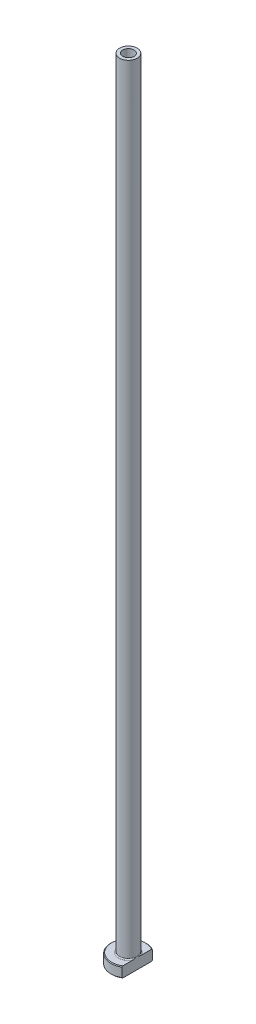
ISO-10303-21;
HEADER;
FILE_DESCRIPTION(('STEP AP214'),'2;1');
FILE_NAME('part.step','',(''),(''),'','','');
FILE_SCHEMA(('AUTOMOTIVE_DESIGN { 1 0 10303 214 1 1 1 1 }'));
ENDSEC;
DATA;
#1=APPLICATION_CONTEXT('core data for automotive mechanical design processes');
#2=APPLICATION_PROTOCOL_DEFINITION('international standard','automotive_design',2000,#1);
#3=PRODUCT_CONTEXT('',#1,'mechanical');
#4=PRODUCT('Part','Part','',(#3));
#5=PRODUCT_RELATED_PRODUCT_CATEGORY('part','',(#4));
#6=PRODUCT_DEFINITION_FORMATION('','',#4);
#7=PRODUCT_DEFINITION_CONTEXT('part definition',#1,'design');
#8=PRODUCT_DEFINITION('design','',#6,#7);
#9=PRODUCT_DEFINITION_SHAPE('','',#8);
#10=(LENGTH_UNIT() NAMED_UNIT(*) SI_UNIT(.MILLI.,.METRE.));
#11=(NAMED_UNIT(*) PLANE_ANGLE_UNIT() SI_UNIT($,.RADIAN.));
#12=(NAMED_UNIT(*) SI_UNIT($,.STERADIAN.) SOLID_ANGLE_UNIT());
#13=UNCERTAINTY_MEASURE_WITH_UNIT(LENGTH_MEASURE(1.E-05),#10,'distance_accuracy_value','');
#14=(GEOMETRIC_REPRESENTATION_CONTEXT(3) GLOBAL_UNCERTAINTY_ASSIGNED_CONTEXT((#13)) GLOBAL_UNIT_ASSIGNED_CONTEXT((#10,
#11,#12)) REPRESENTATION_CONTEXT('',''));
#15=CARTESIAN_POINT('',(0.,0.,0.));
#16=DIRECTION('',(0.,0.,1.));
#17=DIRECTION('',(1.,0.,0.));
#18=AXIS2_PLACEMENT_3D('',#15,#16,#17);
#19=CARTESIAN_POINT('',(0.,92.1876809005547,0.));
#20=DIRECTION('',(0.,1.,0.));
#21=DIRECTION('',(0.,0.,1.));
#22=AXIS2_PLACEMENT_3D('',#19,#20,#21);
#23=CYLINDRICAL_SURFACE('',#22,1.60000000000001);
#24=CARTESIAN_POINT('',(0.,225.,0.));
#25=DIRECTION('',(0.,1.,0.));
#26=DIRECTION('',(0.,0.,1.));
#27=AXIS2_PLACEMENT_3D('',#24,#25,#26);
#28=CIRCLE('',#27,1.60000000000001);
#29=CARTESIAN_POINT('',(0.,225.,1.60000000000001));
#30=VERTEX_POINT('',#29);
#31=EDGE_CURVE('E167',#30,#30,#28,.T.);
#32=ORIENTED_EDGE('',*,*,#31,.T.);
#33=EDGE_LOOP('',(#32));
#34=FACE_BOUND('',#33,.T.);
#35=CARTESIAN_POINT('',(0.,180.,0.));
#36=DIRECTION('',(0.,1.,0.));
#37=DIRECTION('',(0.,0.,1.));
#38=AXIS2_PLACEMENT_3D('',#35,#36,#37);
#39=CIRCLE('',#38,1.60000000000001);
#40=CARTESIAN_POINT('',(0.,180.,1.60000000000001));
#41=VERTEX_POINT('',#40);
#42=EDGE_CURVE('E170',#41,#41,#39,.T.);
#43=ORIENTED_EDGE('',*,*,#42,.F.);
#44=EDGE_LOOP('',(#43));
#45=FACE_BOUND('',#44,.T.);
#46=ADVANCED_FACE('F32',(#34,#45),#23,.F.);
#47=CARTESIAN_POINT('',(-1.60000000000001,225.,0.));
#48=DIRECTION('',(0.,1.,0.));
#49=DIRECTION('',(0.,0.,1.));
#50=AXIS2_PLACEMENT_3D('',#47,#48,#49);
#51=PLANE('',#50);
#52=CARTESIAN_POINT('',(0.,225.,0.));
#53=DIRECTION('',(0.,1.,0.));
#54=DIRECTION('',(0.,0.,1.));
#55=AXIS2_PLACEMENT_3D('',#52,#53,#54);
#56=CIRCLE('',#55,2.50000000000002);
#57=CARTESIAN_POINT('',(0.,225.,2.50000000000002));
#58=VERTEX_POINT('',#57);
#59=EDGE_CURVE('E174',#58,#58,#56,.T.);
#60=ORIENTED_EDGE('',*,*,#59,.T.);
#61=EDGE_LOOP('',(#60));
#62=FACE_BOUND('',#61,.T.);
#63=ORIENTED_EDGE('',*,*,#31,.F.);
#64=EDGE_LOOP('',(#63));
#65=FACE_BOUND('',#64,.T.);
#66=ADVANCED_FACE('F157',(#62,#65),#51,.T.);
#67=CARTESIAN_POINT('',(0.,92.1876809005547,0.));
#68=DIRECTION('',(0.,1.,0.));
#69=DIRECTION('',(0.,0.,1.));
#70=AXIS2_PLACEMENT_3D('',#67,#68,#69);
#71=CYLINDRICAL_SURFACE('',#70,2.5);
#72=CARTESIAN_POINT('',(0.,3.3,0.));
#73=DIRECTION('',(0.,1.,0.));
#74=DIRECTION('',(0.,0.,1.));
#75=AXIS2_PLACEMENT_3D('',#72,#73,#74);
#76=CIRCLE('',#75,2.5);
#77=CARTESIAN_POINT('',(2.5,3.3,0.));
#78=VERTEX_POINT('',#77);
#79=EDGE_CURVE('E180',#78,#78,#76,.T.);
#80=ORIENTED_EDGE('',*,*,#79,.T.);
#81=EDGE_LOOP('',(#80));
#82=FACE_BOUND('',#81,.T.);
#83=ORIENTED_EDGE('',*,*,#59,.F.);
#84=EDGE_LOOP('',(#83));
#85=FACE_BOUND('',#84,.T.);
#86=ADVANCED_FACE('F162',(#82,#85),#71,.T.);
#87=CARTESIAN_POINT('',(-2.49999999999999,3.,0.));
#88=DIRECTION('',(0.,1.,0.));
#89=DIRECTION('',(0.,0.,1.));
#90=AXIS2_PLACEMENT_3D('',#87,#88,#89);
#91=PLANE('',#90);
#92=DIRECTION('',(0.,0.,1.));
#93=VECTOR('',#92,1.);
#94=CARTESIAN_POINT('',(2.49999999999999,3.,0.));
#95=LINE('',#94,#93);
#96=CARTESIAN_POINT('',(2.49999999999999,3.,-4.09756024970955));
#97=VERTEX_POINT('',#96);
#98=CARTESIAN_POINT('',(2.49999999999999,3.,-1.26095202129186));
#99=VERTEX_POINT('',#98);
#100=EDGE_CURVE('E54',#97,#99,#95,.T.);
#101=ORIENTED_EDGE('',*,*,#100,.F.);
#102=CARTESIAN_POINT('',(0.,3.,0.));
#103=DIRECTION('',(0.,1.,0.));
#104=DIRECTION('',(0.,0.,1.));
#105=AXIS2_PLACEMENT_3D('',#102,#103,#104);
#106=CIRCLE('',#105,4.79999999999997);
#107=CARTESIAN_POINT('',(2.49999999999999,3.,4.09756024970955));
#108=VERTEX_POINT('',#107);
#109=EDGE_CURVE('E186',#97,#108,#106,.T.);
#110=ORIENTED_EDGE('',*,*,#109,.T.);
#111=CARTESIAN_POINT('',(2.49999999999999,3.,1.26095202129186));
#112=VERTEX_POINT('',#111);
#113=EDGE_CURVE('E134',#112,#108,#95,.T.);
#114=ORIENTED_EDGE('',*,*,#113,.F.);
#115=CARTESIAN_POINT('',(0.,3.,0.));
#116=DIRECTION('',(0.,1.,0.));
#117=DIRECTION('',(0.,0.,1.));
#118=AXIS2_PLACEMENT_3D('',#115,#116,#117);
#119=CIRCLE('',#118,2.8);
#120=EDGE_CURVE('E183',#112,#99,#119,.F.);
#121=ORIENTED_EDGE('',*,*,#120,.T.);
#122=EDGE_LOOP('',(#101,#110,#114,#121));
#123=FACE_BOUND('',#122,.T.);
#124=ADVANCED_FACE('F197',(#123),#91,.T.);
#125=CARTESIAN_POINT('',(0.,92.1876809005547,0.));
#126=DIRECTION('',(0.,1.,0.));
#127=DIRECTION('',(0.,0.,1.));
#128=AXIS2_PLACEMENT_3D('',#125,#126,#127);
#129=CYLINDRICAL_SURFACE('',#128,4.99999999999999);
#130=DIRECTION('',(0.,-1.,0.));
#131=VECTOR('',#130,1.);
#132=CARTESIAN_POINT('',(2.49999999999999,225.,4.33012701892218));
#133=LINE('',#132,#131);
#134=CARTESIAN_POINT('',(2.49999999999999,2.79999999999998,4.33012701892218));
#135=VERTEX_POINT('',#134);
#136=CARTESIAN_POINT('',(2.49999999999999,0.200000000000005,4.33012701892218));
#137=VERTEX_POINT('',#136);
#138=EDGE_CURVE('E82',#135,#137,#133,.T.);
#139=ORIENTED_EDGE('',*,*,#138,.F.);
#140=CARTESIAN_POINT('',(0.,2.79999999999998,0.));
#141=DIRECTION('',(0.,1.,0.));
#142=DIRECTION('',(0.,0.,1.));
#143=AXIS2_PLACEMENT_3D('',#140,#141,#142);
#144=CIRCLE('',#143,4.99999999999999);
#145=CARTESIAN_POINT('',(2.49999999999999,2.79999999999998,-4.33012701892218));
#146=VERTEX_POINT('',#145);
#147=EDGE_CURVE('E95',#135,#146,#144,.F.);
#148=ORIENTED_EDGE('',*,*,#147,.T.);
#149=DIRECTION('',(0.,-1.,0.));
#150=VECTOR('',#149,1.);
#151=CARTESIAN_POINT('',(2.49999999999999,225.,-4.33012701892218));
#152=LINE('',#151,#150);
#153=CARTESIAN_POINT('',(2.49999999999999,0.200000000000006,-4.33012701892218));
#154=VERTEX_POINT('',#153);
#155=EDGE_CURVE('E192',#146,#154,#152,.T.);
#156=ORIENTED_EDGE('',*,*,#155,.T.);
#157=CARTESIAN_POINT('',(0.,0.200000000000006,0.));
#158=DIRECTION('',(0.,-1.,0.));
#159=DIRECTION('',(0.,0.,-1.));
#160=AXIS2_PLACEMENT_3D('',#157,#158,#159);
#161=CIRCLE('',#160,4.99999999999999);
#162=EDGE_CURVE('E98',#154,#137,#161,.F.);
#163=ORIENTED_EDGE('',*,*,#162,.T.);
#164=EDGE_LOOP('',(#139,#148,#156,#163));
#165=FACE_BOUND('',#164,.T.);
#166=ADVANCED_FACE('F190',(#165),#129,.T.);
#167=CARTESIAN_POINT('',(-4.99999999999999,0.,0.));
#168=DIRECTION('',(0.,-1.,0.));
#169=DIRECTION('',(0.,0.,-1.));
#170=AXIS2_PLACEMENT_3D('',#167,#168,#169);
#171=PLANE('',#170);
#172=CARTESIAN_POINT('',(0.,0.,0.));
#173=DIRECTION('',(0.,-1.,0.));
#174=DIRECTION('',(0.,0.,-1.));
#175=AXIS2_PLACEMENT_3D('',#172,#173,#174);
#176=CIRCLE('',#175,2.34999999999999);
#177=CARTESIAN_POINT('',(0.,0.,-2.34999999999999));
#178=VERTEX_POINT('',#177);
#179=EDGE_CURVE('E40',#178,#178,#176,.F.);
#180=ORIENTED_EDGE('',*,*,#179,.T.);
#181=EDGE_LOOP('',(#180));
#182=FACE_BOUND('',#181,.T.);
#183=DIRECTION('',(0.,0.,-1.));
#184=VECTOR('',#183,1.);
#185=CARTESIAN_POINT('',(2.49999999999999,0.,4.33012701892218));
#186=LINE('',#185,#184);
#187=CARTESIAN_POINT('',(2.49999999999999,0.,4.09756024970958));
#188=VERTEX_POINT('',#187);
#189=CARTESIAN_POINT('',(2.49999999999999,0.,-4.09756024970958));
#190=VERTEX_POINT('',#189);
#191=EDGE_CURVE('E47',#188,#190,#186,.T.);
#192=ORIENTED_EDGE('',*,*,#191,.F.);
#193=CARTESIAN_POINT('',(0.,0.,0.));
#194=DIRECTION('',(0.,-1.,0.));
#195=DIRECTION('',(0.,0.,-1.));
#196=AXIS2_PLACEMENT_3D('',#193,#194,#195);
#197=CIRCLE('',#196,4.8);
#198=EDGE_CURVE('E92',#188,#190,#197,.T.);
#199=ORIENTED_EDGE('',*,*,#198,.T.);
#200=EDGE_LOOP('',(#192,#199));
#201=FACE_BOUND('',#200,.T.);
#202=ADVANCED_FACE('F91',(#182,#201),#171,.T.);
#203=CARTESIAN_POINT('',(0.,92.1876809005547,0.));
#204=DIRECTION('',(0.,1.,0.));
#205=DIRECTION('',(0.,0.,1.));
#206=AXIS2_PLACEMENT_3D('',#203,#204,#205);
#207=CYLINDRICAL_SURFACE('',#206,1.85);
#208=CARTESIAN_POINT('',(0.,0.500000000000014,0.));
#209=DIRECTION('',(0.,-1.,0.));
#210=DIRECTION('',(0.,0.,-1.));
#211=AXIS2_PLACEMENT_3D('',#208,#209,#210);
#212=CIRCLE('',#211,1.85);
#213=CARTESIAN_POINT('',(0.,0.500000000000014,-1.85));
#214=VERTEX_POINT('',#213);
#215=EDGE_CURVE('E11',#214,#214,#212,.T.);
#216=ORIENTED_EDGE('',*,*,#215,.T.);
#217=EDGE_LOOP('',(#216));
#218=FACE_BOUND('',#217,.T.);
#219=CARTESIAN_POINT('',(0.,168.,0.));
#220=DIRECTION('',(0.,1.,0.));
#221=DIRECTION('',(0.,0.,1.));
#222=AXIS2_PLACEMENT_3D('',#219,#220,#221);
#223=CIRCLE('',#222,1.85000000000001);
#224=CARTESIAN_POINT('',(0.,168.,1.85000000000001));
#225=VERTEX_POINT('',#224);
#226=EDGE_CURVE('E172',#225,#225,#223,.T.);
#227=ORIENTED_EDGE('',*,*,#226,.T.);
#228=EDGE_LOOP('',(#227));
#229=FACE_BOUND('',#228,.T.);
#230=ADVANCED_FACE('F215',(#218,#229),#207,.F.);
#231=CARTESIAN_POINT('',(0.,168.,0.));
#232=DIRECTION('',(0.,-1.,0.));
#233=DIRECTION('',(0.,0.,-1.));
#234=AXIS2_PLACEMENT_3D('',#231,#232,#233);
#235=CONICAL_SURFACE('',#234,1.85000000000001,0.0208303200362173);
#236=ORIENTED_EDGE('',*,*,#42,.T.);
#237=EDGE_LOOP('',(#236));
#238=FACE_BOUND('',#237,.T.);
#239=ORIENTED_EDGE('',*,*,#226,.F.);
#240=EDGE_LOOP('',(#239));
#241=FACE_BOUND('',#240,.T.);
#242=ADVANCED_FACE('F111',(#238,#241),#235,.F.);
#243=CARTESIAN_POINT('',(0.,3.3,0.));
#244=DIRECTION('',(0.,1.,0.));
#245=DIRECTION('',(0.,0.,1.));
#246=AXIS2_PLACEMENT_3D('',#243,#244,#245);
#247=TOROIDAL_SURFACE('',#246,2.8,0.3);
#248=ORIENTED_EDGE('',*,*,#120,.F.);
#249=CARTESIAN_POINT('',(2.5,3.3,0.));
#250=CARTESIAN_POINT('',(2.5,3.30000062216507,-4.8426698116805E-11));
#251=CARTESIAN_POINT('',(2.5,3.30000124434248,1.59621067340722E-07));
#252=CARTESIAN_POINT('',(2.5,3.30000243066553,6.45478006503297E-07));
#253=CARTESIAN_POINT('',(2.5,3.30000299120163,9.78480760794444E-07));
#254=CARTESIAN_POINT('',(2.5,3.30000411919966,1.77471990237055E-06));
#255=CARTESIAN_POINT('',(2.5,3.30000467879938,2.24902156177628E-06));
#256=CARTESIAN_POINT('',(2.5,3.30000572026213,3.25953696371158E-06));
#257=CARTESIAN_POINT('',(2.5,3.30000620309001,3.79480759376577E-06));
#258=CARTESIAN_POINT('',(2.5,3.30000787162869,5.75794663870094E-06));
#259=CARTESIAN_POINT('',(2.5,3.300008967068,7.26424163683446E-06));
#260=CARTESIAN_POINT('',(2.5,3.30001087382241,1.03361136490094E-05));
#261=CARTESIAN_POINT('',(2.5,3.30001169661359,1.18949506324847E-05));
#262=CARTESIAN_POINT('',(2.5,3.30001489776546,1.81400864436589E-05));
#263=CARTESIAN_POINT('',(2.5,3.30001712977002,2.29062195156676E-05));
#264=CARTESIAN_POINT('',(2.5,3.30002067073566,3.21793887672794E-05));
#265=CARTESIAN_POINT('',(2.5,3.30002205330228,3.66589008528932E-05));
#266=CARTESIAN_POINT('',(2.5,3.30002810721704,5.61718435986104E-05));
#267=CARTESIAN_POINT('',(2.5,3.30003284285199,7.11735908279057E-05));
#268=CARTESIAN_POINT('',(2.49999999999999,3.3000402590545,9.89920379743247E-05));
#269=CARTESIAN_POINT('',(2.49999999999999,3.30004315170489,0.000111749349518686));
#270=CARTESIAN_POINT('',(2.49999999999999,3.30006652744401,0.000206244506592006));
#271=CARTESIAN_POINT('',(2.49999999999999,3.30009698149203,0.000285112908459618));
#272=CARTESIAN_POINT('',(2.5,3.30021213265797,0.000594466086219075));
#273=CARTESIAN_POINT('',(2.5,3.30028938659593,0.000826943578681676));
#274=CARTESIAN_POINT('',(2.49999999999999,3.30059681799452,0.00173885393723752));
#275=CARTESIAN_POINT('',(2.49999999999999,3.30083479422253,0.00241625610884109));
#276=CARTESIAN_POINT('',(2.5,3.30181198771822,0.00521069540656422));
#277=CARTESIAN_POINT('',(2.5,3.30254240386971,0.0073299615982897));
#278=CARTESIAN_POINT('',(2.49999999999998,3.31226043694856,0.0355096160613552));
#279=CARTESIAN_POINT('',(2.49999999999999,3.32130808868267,0.061555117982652));
#280=CARTESIAN_POINT('',(2.5,3.33896212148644,0.112677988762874));
#281=CARTESIAN_POINT('',(2.5,3.34757212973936,0.137754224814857));
#282=CARTESIAN_POINT('',(2.49999999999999,3.3657306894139,0.190981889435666));
#283=CARTESIAN_POINT('',(2.49999999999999,3.37526654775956,0.21913775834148));
#284=CARTESIAN_POINT('',(2.49999999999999,3.39422867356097,0.275816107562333));
#285=CARTESIAN_POINT('',(2.49999999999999,3.40365272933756,0.304339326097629));
#286=CARTESIAN_POINT('',(2.49999999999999,3.42641697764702,0.374416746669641));
#287=CARTESIAN_POINT('',(2.49999999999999,3.43959811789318,0.416023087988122));
#288=CARTESIAN_POINT('',(2.49999999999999,3.46479157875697,0.498481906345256));
#289=CARTESIAN_POINT('',(2.49999999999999,3.47682455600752,0.53932804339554));
#290=CARTESIAN_POINT('',(2.49999999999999,3.50224427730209,0.629981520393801));
#291=CARTESIAN_POINT('',(2.49999999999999,3.51538048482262,0.679860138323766));
#292=CARTESIAN_POINT('',(2.49999999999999,3.53964074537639,0.78051176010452));
#293=CARTESIAN_POINT('',(2.49999999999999,3.55074877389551,0.831288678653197));
#294=CARTESIAN_POINT('',(2.49999999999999,3.57087054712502,0.937063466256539));
#295=CARTESIAN_POINT('',(2.49999999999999,3.5796762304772,0.99210227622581));
#296=CARTESIAN_POINT('',(2.49999999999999,3.59301148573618,1.10256024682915));
#297=CARTESIAN_POINT('',(2.49999999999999,3.59755297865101,1.15797790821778));
#298=CARTESIAN_POINT('',(2.49999999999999,3.60093314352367,1.26786705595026));
#299=CARTESIAN_POINT('',(2.49999999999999,3.59989366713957,1.32233291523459));
#300=CARTESIAN_POINT('',(2.49999999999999,3.592772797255,1.40310062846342));
#301=CARTESIAN_POINT('',(2.49999999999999,3.58952137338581,1.42965222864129));
#302=CARTESIAN_POINT('',(2.49999999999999,3.5808585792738,1.48239078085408));
#303=CARTESIAN_POINT('',(2.49999999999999,3.57544928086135,1.50857805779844));
#304=CARTESIAN_POINT('',(2.49999999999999,3.56298810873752,1.55658799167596));
#305=CARTESIAN_POINT('',(2.49999999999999,3.55628200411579,1.57849902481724));
#306=CARTESIAN_POINT('',(2.49999999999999,3.5405539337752,1.62160292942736));
#307=CARTESIAN_POINT('',(2.49999999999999,3.53152220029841,1.642792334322));
#308=CARTESIAN_POINT('',(2.49999999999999,3.51057199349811,1.6840446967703));
#309=CARTESIAN_POINT('',(2.49999999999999,3.49862012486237,1.70409105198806));
#310=CARTESIAN_POINT('',(2.49999999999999,3.47134074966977,1.74172093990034));
#311=CARTESIAN_POINT('',(2.49999999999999,3.45603127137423,1.75931683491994));
#312=CARTESIAN_POINT('',(2.49999999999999,3.42979930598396,1.78297070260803));
#313=CARTESIAN_POINT('',(2.49999999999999,3.42024268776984,1.79054141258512));
#314=CARTESIAN_POINT('',(2.49999999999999,3.40009035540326,1.80416997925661));
#315=CARTESIAN_POINT('',(2.49999999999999,3.38949499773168,1.81022835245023));
#316=CARTESIAN_POINT('',(2.49999999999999,3.36727740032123,1.8204708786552));
#317=CARTESIAN_POINT('',(2.49999999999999,3.35564531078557,1.82463409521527));
#318=CARTESIAN_POINT('',(2.49999999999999,3.33178837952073,1.83058442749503));
#319=CARTESIAN_POINT('',(2.49999999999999,3.31956435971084,1.83237474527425));
#320=CARTESIAN_POINT('',(2.49999999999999,3.29665736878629,1.83331852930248));
#321=CARTESIAN_POINT('',(2.49999999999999,3.28598670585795,1.83279233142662));
#322=CARTESIAN_POINT('',(2.49999999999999,3.26490749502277,1.82986307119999));
#323=CARTESIAN_POINT('',(2.49999999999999,3.25449899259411,1.82745968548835));
#324=CARTESIAN_POINT('',(2.49999999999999,3.2346709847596,1.82111257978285));
#325=CARTESIAN_POINT('',(2.49999999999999,3.22522816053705,1.81724026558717));
#326=CARTESIAN_POINT('',(2.49999999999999,3.20699535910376,1.80819497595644));
#327=CARTESIAN_POINT('',(2.49999999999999,3.19820556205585,1.80302164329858));
#328=CARTESIAN_POINT('',(2.49999999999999,3.17663162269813,1.78842115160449));
#329=CARTESIAN_POINT('',(2.49999999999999,3.16436228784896,1.77823293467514));
#330=CARTESIAN_POINT('',(2.49999999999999,3.1415782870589,1.75604629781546));
#331=CARTESIAN_POINT('',(2.49999999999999,3.13106906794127,1.74404246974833));
#332=CARTESIAN_POINT('',(2.49999999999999,3.10600520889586,1.71142114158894));
#333=CARTESIAN_POINT('',(2.49999999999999,3.09267476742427,1.68986887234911));
#334=CARTESIAN_POINT('',(2.49999999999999,3.06940323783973,1.64508572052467));
#335=CARTESIAN_POINT('',(2.49999999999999,3.05946314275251,1.62185434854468));
#336=CARTESIAN_POINT('',(2.49999999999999,3.03545750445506,1.55546754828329));
#337=CARTESIAN_POINT('',(2.49999999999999,3.02444022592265,1.51122187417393));
#338=CARTESIAN_POINT('',(2.49999999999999,3.00863926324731,1.42119777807));
#339=CARTESIAN_POINT('',(2.49999999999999,3.00393876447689,1.37540689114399));
#340=CARTESIAN_POINT('',(2.49999999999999,2.9992421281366,1.28072198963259));
#341=CARTESIAN_POINT('',(2.49999999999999,2.99956098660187,1.23181420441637));
#342=CARTESIAN_POINT('',(2.49999999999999,3.00436098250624,1.13410944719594));
#343=CARTESIAN_POINT('',(2.49999999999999,3.00885327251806,1.0853131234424));
#344=CARTESIAN_POINT('',(2.49999999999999,3.02074191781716,0.990773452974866));
#345=CARTESIAN_POINT('',(2.49999999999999,3.02796792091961,0.945007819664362));
#346=CARTESIAN_POINT('',(2.49999999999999,3.04465555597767,0.854199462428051));
#347=CARTESIAN_POINT('',(2.49999999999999,3.05410250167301,0.809153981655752));
#348=CARTESIAN_POINT('',(2.49999999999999,3.07710029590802,0.709411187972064));
#349=CARTESIAN_POINT('',(2.49999999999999,3.09109633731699,0.654817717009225));
#350=CARTESIAN_POINT('',(2.49999999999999,3.12140740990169,0.544863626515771));
#351=CARTESIAN_POINT('',(2.49999999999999,3.1377704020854,0.489516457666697));
#352=CARTESIAN_POINT('',(2.49999999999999,3.16649540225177,0.396740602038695));
#353=CARTESIAN_POINT('',(2.5,3.17848130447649,0.359193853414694));
#354=CARTESIAN_POINT('',(2.49999999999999,3.20280507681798,0.284651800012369));
#355=CARTESIAN_POINT('',(2.49999999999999,3.21513791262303,0.247654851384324));
#356=CARTESIAN_POINT('',(2.5,3.23873713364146,0.177767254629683));
#357=CARTESIAN_POINT('',(2.50000000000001,3.24997409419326,0.144866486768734));
#358=CARTESIAN_POINT('',(2.49999999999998,3.2730714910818,0.0777985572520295));
#359=CARTESIAN_POINT('',(2.49999999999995,3.28493883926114,0.0436336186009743));
#360=CARTESIAN_POINT('',(2.5,3.29745794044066,0.00732879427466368));
#361=CARTESIAN_POINT('',(2.5,3.29818879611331,0.00520838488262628));
#362=CARTESIAN_POINT('',(2.49999999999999,3.29916610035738,0.00241367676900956));
#363=CARTESIAN_POINT('',(2.49999999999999,3.29940376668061,0.00173715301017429));
#364=CARTESIAN_POINT('',(2.5,3.29971082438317,0.000826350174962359));
#365=CARTESIAN_POINT('',(2.5,3.29978800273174,0.000594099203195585));
#366=CARTESIAN_POINT('',(2.49999999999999,3.299903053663,0.000285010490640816));
#367=CARTESIAN_POINT('',(2.49999999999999,3.29993349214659,0.000206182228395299));
#368=CARTESIAN_POINT('',(2.49999999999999,3.299956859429,0.000111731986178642));
#369=CARTESIAN_POINT('',(2.5,3.29995975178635,9.89774369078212E-05));
#370=CARTESIAN_POINT('',(2.5,3.29996716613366,7.11651920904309E-05));
#371=CARTESIAN_POINT('',(2.5,3.29997189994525,5.61668122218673E-05));
#372=CARTESIAN_POINT('',(2.5,3.29997795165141,3.66576343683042E-05));
#373=CARTESIAN_POINT('',(2.5,3.29997933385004,3.21785261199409E-05));
#374=CARTESIAN_POINT('',(2.5,3.29998287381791,2.29061387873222E-05));
#375=CARTESIAN_POINT('',(2.5,3.29998510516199,1.81403670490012E-05));
#376=CARTESIAN_POINT('',(2.5,3.29998830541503,1.18955826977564E-05));
#377=CARTESIAN_POINT('',(2.5,3.29998912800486,1.03367766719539E-05));
#378=CARTESIAN_POINT('',(2.5,3.29999103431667,7.26492818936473E-06));
#379=CARTESIAN_POINT('',(2.5,3.29999212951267,5.75862304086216E-06));
#380=CARTESIAN_POINT('',(2.5,3.29999379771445,3.79542474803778E-06));
#381=CARTESIAN_POINT('',(2.5,3.29999428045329,3.26012767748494E-06));
#382=CARTESIAN_POINT('',(2.5,3.29999532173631,2.24954336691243E-06));
#383=CARTESIAN_POINT('',(2.5,3.2999958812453,1.77519896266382E-06));
#384=CARTESIAN_POINT('',(2.5,3.29999700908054,9.78857096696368E-07));
#385=CARTESIAN_POINT('',(2.5,3.29999756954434,6.45797055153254E-07));
#386=CARTESIAN_POINT('',(2.5,3.29999875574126,1.59799604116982E-07));
#387=CARTESIAN_POINT('',(2.5,3.29999937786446,4.84248995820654E-11));
#388=CARTESIAN_POINT('',(2.5,3.3,0.));
#389=B_SPLINE_CURVE_WITH_KNOTS('',3,(#249,#250,#251,#252,#253,#254,#255,#256,#257,#258,#259,
#260,#261,#262,#263,#264,#265,#266,#267,#268,#269,#270,#271,#272,#273,#274,#275,#276,#277,#278,
#279,#280,#281,#282,#283,#284,#285,#286,#287,#288,#289,#290,#291,#292,#293,#294,#295,#296,#297,
#298,#299,#300,#301,#302,#303,#304,#305,#306,#307,#308,#309,#310,#311,#312,#313,#314,#315,#316,
#317,#318,#319,#320,#321,#322,#323,#324,#325,#326,#327,#328,#329,#330,#331,#332,#333,#334,#335,
#336,#337,#338,#339,#340,#341,#342,#343,#344,#345,#346,#347,#348,#349,#350,#351,#352,#353,#354,
#355,#356,#357,#358,#359,#360,#361,#362,#363,#364,#365,#366,#367,#368,#369,#370,#371,#372,#373,
#374,#375,#376,#377,#378,#379,#380,#381,#382,#383,#384,#385,#386,#387,#388),.UNSPECIFIED.,.T.,
.F.,(4,2,2,2,2,2,2,2,2,2,2,2,2,2,2,2,2,2,2,2,2,2,2,2,2,2,2,2,2,2,2,2,2,2,2,2,2,2,2,2,2,2,2,2,2,
2,2,2,2,2,2,2,2,2,2,2,2,2,2,2,2,2,2,2,2,2,2,2,2,4),(0.,1.86789173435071E-06,
3.81549499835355E-06,6.00610318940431E-06,8.16652773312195E-06,1.37285566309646E-05,
1.90122141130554E-05,3.47597261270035E-05,4.88082581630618E-05,9.59978424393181E-05,
0.000135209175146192,0.000388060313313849,0.00112364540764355,0.00327678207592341,
0.0100024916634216,0.0927120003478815,0.172253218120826,0.261432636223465,0.351551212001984,
0.482477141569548,0.610212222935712,0.764915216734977,0.920792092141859,1.08787897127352,
1.2544973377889,1.41749285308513,1.49767530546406,1.57778095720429,1.64642481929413,
1.71536183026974,1.78512750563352,1.85452737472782,1.89099315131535,1.92744645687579,
1.96429324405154,2.00109025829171,2.03297105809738,2.06485735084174,2.09535926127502,
2.12586955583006,2.17344034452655,2.22115572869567,2.29675134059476,2.37236907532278,
2.50839721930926,2.64619971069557,2.79268284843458,2.93955855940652,3.07848421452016,
3.21651583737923,3.38554045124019,3.55865938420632,3.67689643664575,3.79388863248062,
3.89819085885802,4.00668323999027,4.01341261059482,4.01556295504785,4.01629782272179,
4.01655054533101,4.01658974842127,4.01663692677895,4.01665097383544,4.01666671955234,
4.01667200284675,4.016677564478,4.01667972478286,4.01668191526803,4.01668386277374,
4.01668573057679),.UNSPECIFIED.);
#390=EDGE_CURVE('E126',#112,#78,#389,.T.);
#391=ORIENTED_EDGE('',*,*,#390,.T.);
#392=ORIENTED_EDGE('',*,*,#79,.F.);
#393=CARTESIAN_POINT('',(2.5,3.3,0.));
#394=CARTESIAN_POINT('',(2.5,3.29999937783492,4.84272985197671E-11));
#395=CARTESIAN_POINT('',(2.5,3.29999875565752,-1.59621066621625E-07));
#396=CARTESIAN_POINT('',(2.5,3.29999756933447,-6.45478005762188E-07));
#397=CARTESIAN_POINT('',(2.5,3.29999700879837,-9.78480760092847E-07));
#398=CARTESIAN_POINT('',(2.5,3.29999588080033,-1.77471990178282E-06));
#399=CARTESIAN_POINT('',(2.5,3.29999532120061,-2.24902156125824E-06));
#400=CARTESIAN_POINT('',(2.5,3.29999427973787,-3.25953696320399E-06));
#401=CARTESIAN_POINT('',(2.5,3.29999379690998,-3.79480759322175E-06));
#402=CARTESIAN_POINT('',(2.5,3.2999921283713,-5.75794663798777E-06));
#403=CARTESIAN_POINT('',(2.5,3.29999103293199,-7.26424163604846E-06));
#404=CARTESIAN_POINT('',(2.5,3.29998912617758,-1.03361136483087E-05));
#405=CARTESIAN_POINT('',(2.5,3.2999883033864,-1.18949506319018E-05));
#406=CARTESIAN_POINT('',(2.5,3.29998510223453,-1.8140086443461E-05));
#407=CARTESIAN_POINT('',(2.5,3.29998287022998,-2.29062195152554E-05));
#408=CARTESIAN_POINT('',(2.5,3.29997932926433,-3.21793887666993E-05));
#409=CARTESIAN_POINT('',(2.5,3.29997794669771,-3.66589008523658E-05));
#410=CARTESIAN_POINT('',(2.5,3.29997189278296,-5.61718435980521E-05));
#411=CARTESIAN_POINT('',(2.5,3.29996715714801,-7.11735908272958E-05));
#412=CARTESIAN_POINT('',(2.49999999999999,3.2999597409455,-9.89920379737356E-05));
#413=CARTESIAN_POINT('',(2.49999999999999,3.29995684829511,-0.000111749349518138));
#414=CARTESIAN_POINT('',(2.49999999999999,3.29993347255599,-0.000206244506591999));
#415=CARTESIAN_POINT('',(2.49999999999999,3.29990301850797,-0.00028511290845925));
#416=CARTESIAN_POINT('',(2.49999999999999,3.29978786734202,-0.000594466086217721));
#417=CARTESIAN_POINT('',(2.49999999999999,3.29971061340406,-0.000826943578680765));
#418=CARTESIAN_POINT('',(2.49999999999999,3.29940318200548,-0.00173885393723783));
#419=CARTESIAN_POINT('',(2.49999999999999,3.29916520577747,-0.00241625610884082));
#420=CARTESIAN_POINT('',(2.49999999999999,3.29818801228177,-0.00521069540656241));
#421=CARTESIAN_POINT('',(2.49999999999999,3.29745759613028,-0.00732996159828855));
#422=CARTESIAN_POINT('',(2.49999999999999,3.28773956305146,-0.0355096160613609));
#423=CARTESIAN_POINT('',(2.49999999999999,3.27869191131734,-0.061555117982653));
#424=CARTESIAN_POINT('',(2.49999999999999,3.26103787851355,-0.112677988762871));
#425=CARTESIAN_POINT('',(2.49999999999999,3.25242787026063,-0.137754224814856));
#426=CARTESIAN_POINT('',(2.49999999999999,3.23426931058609,-0.190981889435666));
#427=CARTESIAN_POINT('',(2.49999999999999,3.22473345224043,-0.21913775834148));
#428=CARTESIAN_POINT('',(2.49999999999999,3.20577132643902,-0.275816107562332));
#429=CARTESIAN_POINT('',(2.49999999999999,3.19634727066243,-0.304339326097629));
#430=CARTESIAN_POINT('',(2.49999999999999,3.17358302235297,-0.374416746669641));
#431=CARTESIAN_POINT('',(2.49999999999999,3.16040188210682,-0.416023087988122));
#432=CARTESIAN_POINT('',(2.49999999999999,3.13520842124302,-0.498481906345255));
#433=CARTESIAN_POINT('',(2.49999999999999,3.12317544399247,-0.53932804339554));
#434=CARTESIAN_POINT('',(2.49999999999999,3.0977557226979,-0.6299815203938));
#435=CARTESIAN_POINT('',(2.49999999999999,3.08461951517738,-0.679860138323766));
#436=CARTESIAN_POINT('',(2.49999999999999,3.06035925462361,-0.78051176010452));
#437=CARTESIAN_POINT('',(2.49999999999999,3.04925122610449,-0.831288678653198));
#438=CARTESIAN_POINT('',(2.49999999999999,3.02912945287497,-0.93706346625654));
#439=CARTESIAN_POINT('',(2.49999999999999,3.0203237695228,-0.992102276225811));
#440=CARTESIAN_POINT('',(2.49999999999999,3.00698851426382,-1.10256024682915));
#441=CARTESIAN_POINT('',(2.49999999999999,3.00244702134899,-1.15797790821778));
#442=CARTESIAN_POINT('',(2.49999999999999,2.99906685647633,-1.26786705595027));
#443=CARTESIAN_POINT('',(2.49999999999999,3.00010633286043,-1.32233291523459));
#444=CARTESIAN_POINT('',(2.49999999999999,3.007227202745,-1.40310062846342));
#445=CARTESIAN_POINT('',(2.49999999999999,3.01047862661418,-1.4296522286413));
#446=CARTESIAN_POINT('',(2.49999999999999,3.0191414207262,-1.48239078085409));
#447=CARTESIAN_POINT('',(2.49999999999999,3.02455071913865,-1.50857805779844));
#448=CARTESIAN_POINT('',(2.49999999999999,3.03701189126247,-1.55658799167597));
#449=CARTESIAN_POINT('',(2.49999999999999,3.04371799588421,-1.57849902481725));
#450=CARTESIAN_POINT('',(2.49999999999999,3.0594460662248,-1.62160292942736));
#451=CARTESIAN_POINT('',(2.49999999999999,3.06847779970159,-1.642792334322));
#452=CARTESIAN_POINT('',(2.49999999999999,3.08942800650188,-1.6840446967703));
#453=CARTESIAN_POINT('',(2.49999999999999,3.10137987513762,-1.70409105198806));
#454=CARTESIAN_POINT('',(2.49999999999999,3.12865925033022,-1.74172093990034));
#455=CARTESIAN_POINT('',(2.49999999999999,3.14396872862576,-1.75931683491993));
#456=CARTESIAN_POINT('',(2.49999999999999,3.17020069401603,-1.78297070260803));
#457=CARTESIAN_POINT('',(2.49999999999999,3.17975731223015,-1.79054141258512));
#458=CARTESIAN_POINT('',(2.49999999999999,3.19990964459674,-1.80416997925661));
#459=CARTESIAN_POINT('',(2.49999999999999,3.21050500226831,-1.81022835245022));
#460=CARTESIAN_POINT('',(2.49999999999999,3.23272259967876,-1.8204708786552));
#461=CARTESIAN_POINT('',(2.49999999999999,3.24435468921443,-1.82463409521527));
#462=CARTESIAN_POINT('',(2.49999999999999,3.26821162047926,-1.83058442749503));
#463=CARTESIAN_POINT('',(2.49999999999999,3.28043564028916,-1.83237474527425));
#464=CARTESIAN_POINT('',(2.49999999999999,3.3033426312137,-1.83331852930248));
#465=CARTESIAN_POINT('',(2.49999999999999,3.31401329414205,-1.83279233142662));
#466=CARTESIAN_POINT('',(2.49999999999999,3.33509250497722,-1.82986307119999));
#467=CARTESIAN_POINT('',(2.49999999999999,3.34550100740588,-1.82745968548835));
#468=CARTESIAN_POINT('',(2.49999999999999,3.3653290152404,-1.82111257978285));
#469=CARTESIAN_POINT('',(2.49999999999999,3.37477183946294,-1.81724026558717));
#470=CARTESIAN_POINT('',(2.49999999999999,3.39300464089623,-1.80819497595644));
#471=CARTESIAN_POINT('',(2.49999999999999,3.40179443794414,-1.80302164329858));
#472=CARTESIAN_POINT('',(2.49999999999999,3.42336837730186,-1.78842115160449));
#473=CARTESIAN_POINT('',(2.49999999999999,3.43563771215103,-1.77823293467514));
#474=CARTESIAN_POINT('',(2.49999999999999,3.4584217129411,-1.75604629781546));
#475=CARTESIAN_POINT('',(2.49999999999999,3.46893093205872,-1.74404246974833));
#476=CARTESIAN_POINT('',(2.49999999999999,3.49399479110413,-1.71142114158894));
#477=CARTESIAN_POINT('',(2.49999999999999,3.50732523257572,-1.68986887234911));
#478=CARTESIAN_POINT('',(2.49999999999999,3.53059676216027,-1.64508572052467));
#479=CARTESIAN_POINT('',(2.49999999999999,3.54053685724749,-1.62185434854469));
#480=CARTESIAN_POINT('',(2.49999999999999,3.56454249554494,-1.55546754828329));
#481=CARTESIAN_POINT('',(2.49999999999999,3.57555977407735,-1.51122187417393));
#482=CARTESIAN_POINT('',(2.49999999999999,3.59136073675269,-1.42119777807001));
#483=CARTESIAN_POINT('',(2.49999999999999,3.5960612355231,-1.37540689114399));
#484=CARTESIAN_POINT('',(2.49999999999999,3.6007578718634,-1.28072198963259));
#485=CARTESIAN_POINT('',(2.49999999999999,3.60043901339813,-1.23181420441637));
#486=CARTESIAN_POINT('',(2.49999999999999,3.59563901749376,-1.13410944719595));
#487=CARTESIAN_POINT('',(2.49999999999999,3.59114672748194,-1.08531312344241));
#488=CARTESIAN_POINT('',(2.49999999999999,3.57925808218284,-0.990773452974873));
#489=CARTESIAN_POINT('',(2.49999999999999,3.57203207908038,-0.945007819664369));
#490=CARTESIAN_POINT('',(2.49999999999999,3.55534444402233,-0.854199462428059));
#491=CARTESIAN_POINT('',(2.49999999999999,3.54589749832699,-0.80915398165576));
#492=CARTESIAN_POINT('',(2.49999999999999,3.52289970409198,-0.709411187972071));
#493=CARTESIAN_POINT('',(2.49999999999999,3.508903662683,-0.654817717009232));
#494=CARTESIAN_POINT('',(2.49999999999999,3.47859259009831,-0.544863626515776));
#495=CARTESIAN_POINT('',(2.49999999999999,3.4622295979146,-0.4895164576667));
#496=CARTESIAN_POINT('',(2.49999999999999,3.43350459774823,-0.396740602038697));
#497=CARTESIAN_POINT('',(2.49999999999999,3.4215186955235,-0.359193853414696));
#498=CARTESIAN_POINT('',(2.49999999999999,3.39719492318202,-0.284651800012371));
#499=CARTESIAN_POINT('',(2.49999999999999,3.38486208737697,-0.247654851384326));
#500=CARTESIAN_POINT('',(2.5,3.36126286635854,-0.177767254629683));
#501=CARTESIAN_POINT('',(2.5,3.35002590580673,-0.144866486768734));
#502=CARTESIAN_POINT('',(2.49999999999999,3.3269285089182,-0.0777985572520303));
#503=CARTESIAN_POINT('',(2.49999999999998,3.31506116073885,-0.0436336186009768));
#504=CARTESIAN_POINT('',(2.5,3.30254205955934,-0.00732879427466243));
#505=CARTESIAN_POINT('',(2.5,3.30181120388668,-0.00520838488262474));
#506=CARTESIAN_POINT('',(2.49999999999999,3.30083389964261,-0.00241367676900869));
#507=CARTESIAN_POINT('',(2.49999999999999,3.30059623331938,-0.00173715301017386));
#508=CARTESIAN_POINT('',(2.49999999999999,3.30028917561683,-0.000826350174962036));
#509=CARTESIAN_POINT('',(2.5,3.30021199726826,-0.000594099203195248));
#510=CARTESIAN_POINT('',(2.49999999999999,3.30009694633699,-0.000285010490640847));
#511=CARTESIAN_POINT('',(2.49999999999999,3.30006650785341,-0.000206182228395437));
#512=CARTESIAN_POINT('',(2.49999999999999,3.300043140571,-0.000111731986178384));
#513=CARTESIAN_POINT('',(2.49999999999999,3.30004024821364,-9.89774369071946E-05));
#514=CARTESIAN_POINT('',(2.5,3.30003283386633,-7.11651920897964E-05));
#515=CARTESIAN_POINT('',(2.5,3.30002810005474,-5.61668122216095E-05));
#516=CARTESIAN_POINT('',(2.5,3.30002204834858,-3.66576343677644E-05));
#517=CARTESIAN_POINT('',(2.5,3.30002066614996,-3.21785261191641E-05));
#518=CARTESIAN_POINT('',(2.5,3.30001712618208,-2.29061387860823E-05));
#519=CARTESIAN_POINT('',(2.5,3.30001489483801,-1.81403670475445E-05));
#520=CARTESIAN_POINT('',(2.5,3.30001169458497,-1.18955826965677E-05));
#521=CARTESIAN_POINT('',(2.5,3.30001087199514,-1.03367766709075E-05));
#522=CARTESIAN_POINT('',(2.5,3.30000896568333,-7.26492818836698E-06));
#523=CARTESIAN_POINT('',(2.5,3.30000787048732,-5.75862303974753E-06));
#524=CARTESIAN_POINT('',(2.5,3.30000620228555,-3.79542474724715E-06));
#525=CARTESIAN_POINT('',(2.5,3.3000057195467,-3.26012767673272E-06));
#526=CARTESIAN_POINT('',(2.5,3.30000467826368,-2.24954336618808E-06));
#527=CARTESIAN_POINT('',(2.5,3.3000041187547,-1.77519896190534E-06));
#528=CARTESIAN_POINT('',(2.5,3.30000299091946,-9.78857095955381E-07));
#529=CARTESIAN_POINT('',(2.5,3.30000243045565,-6.45797054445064E-07));
#530=CARTESIAN_POINT('',(2.5,3.30000124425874,-1.59799603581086E-07));
#531=CARTESIAN_POINT('',(2.5,3.30000062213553,-4.84244984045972E-11));
#532=CARTESIAN_POINT('',(2.5,3.3,0.));
#533=B_SPLINE_CURVE_WITH_KNOTS('',3,(#393,#394,#395,#396,#397,#398,#399,#400,#401,#402,#403,
#404,#405,#406,#407,#408,#409,#410,#411,#412,#413,#414,#415,#416,#417,#418,#419,#420,#421,#422,
#423,#424,#425,#426,#427,#428,#429,#430,#431,#432,#433,#434,#435,#436,#437,#438,#439,#440,#441,
#442,#443,#444,#445,#446,#447,#448,#449,#450,#451,#452,#453,#454,#455,#456,#457,#458,#459,#460,
#461,#462,#463,#464,#465,#466,#467,#468,#469,#470,#471,#472,#473,#474,#475,#476,#477,#478,#479,
#480,#481,#482,#483,#484,#485,#486,#487,#488,#489,#490,#491,#492,#493,#494,#495,#496,#497,#498,
#499,#500,#501,#502,#503,#504,#505,#506,#507,#508,#509,#510,#511,#512,#513,#514,#515,#516,#517,
#518,#519,#520,#521,#522,#523,#524,#525,#526,#527,#528,#529,#530,#531,#532),.UNSPECIFIED.,.T.,
.F.,(4,2,2,2,2,2,2,2,2,2,2,2,2,2,2,2,2,2,2,2,2,2,2,2,2,2,2,2,2,2,2,2,2,2,2,2,2,2,2,2,2,2,2,2,2,
2,2,2,2,2,2,2,2,2,2,2,2,2,2,2,2,2,2,2,2,2,2,2,2,4),(0.,1.86789173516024E-06,3.8154949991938E-06,
6.00610318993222E-06,8.16652773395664E-06,1.37285566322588E-05,1.90122141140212E-05,
3.47597261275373E-05,4.88082581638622E-05,9.59978424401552E-05,0.000135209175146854,
0.000388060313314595,0.00112364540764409,0.00327678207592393,0.0100024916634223,
0.092712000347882,0.172253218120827,0.261432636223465,0.351551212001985,0.482477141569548,
0.610212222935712,0.764915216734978,0.920792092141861,1.08787897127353,1.25449733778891,
1.41749285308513,1.49767530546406,1.5777809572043,1.64642481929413,1.71536183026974,
1.78512750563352,1.85452737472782,1.89099315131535,1.92744645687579,1.96429324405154,
2.00109025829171,2.03297105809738,2.06485735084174,2.09535926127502,2.12586955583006,
2.17344034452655,2.22115572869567,2.29675134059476,2.37236907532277,2.50839721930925,
2.64619971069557,2.79268284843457,2.93955855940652,3.07848421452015,3.21651583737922,
3.38554045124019,3.55865938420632,3.67689643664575,3.79388863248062,3.89819085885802,
4.00668323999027,4.01341261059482,4.01556295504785,4.01629782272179,4.01655054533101,
4.01658974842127,4.01663692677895,4.01665097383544,4.01666671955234,4.01667200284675,
4.016677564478,4.01667972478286,4.01668191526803,4.01668386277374,4.01668573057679),.UNSPECIFIED.);
#534=EDGE_CURVE('E135',#78,#99,#533,.T.);
#535=ORIENTED_EDGE('',*,*,#534,.T.);
#536=EDGE_LOOP('',(#248,#391,#392,#535));
#537=FACE_BOUND('',#536,.T.);
#538=ADVANCED_FACE('F141',(#537),#247,.F.);
#539=CARTESIAN_POINT('',(0.,3.,0.));
#540=DIRECTION('',(0.,-1.,0.));
#541=DIRECTION('',(0.,0.,-1.));
#542=AXIS2_PLACEMENT_3D('',#539,#540,#541);
#543=CONICAL_SURFACE('',#542,4.79999999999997,0.785398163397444);
#544=CARTESIAN_POINT('',(2.5,-2.05039133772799,-9.52786489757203));
#545=CARTESIAN_POINT('',(2.5,-1.84160367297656,-9.31199733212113));
#546=CARTESIAN_POINT('',(2.5,-1.63304008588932,-9.09591231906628));
#547=CARTESIAN_POINT('',(2.5,-1.21649358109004,-8.66317810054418));
#548=CARTESIAN_POINT('',(2.5,-1.00851067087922,-8.4465288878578));
#549=CARTESIAN_POINT('',(2.5,-0.593157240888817,-8.01243155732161));
#550=CARTESIAN_POINT('',(2.5,-0.385787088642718,-7.79498308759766));
#551=CARTESIAN_POINT('',(2.5,0.0280365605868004,-7.35921771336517));
#552=CARTESIAN_POINT('',(2.5,0.234490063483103,-7.14090081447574));
#553=CARTESIAN_POINT('',(2.5,0.642130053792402,-6.70748960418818));
#554=CARTESIAN_POINT('',(2.49999999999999,0.843339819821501,-6.49241720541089));
#555=CARTESIAN_POINT('',(2.49999999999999,1.24425381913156,-6.06087422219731));
#556=CARTESIAN_POINT('',(2.49999999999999,1.44395806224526,-5.84440364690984));
#557=CARTESIAN_POINT('',(2.49999999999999,1.8412775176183,-5.40963663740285));
#558=CARTESIAN_POINT('',(2.49999999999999,2.03889317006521,-5.19134060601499));
#559=CARTESIAN_POINT('',(2.49999999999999,2.4312504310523,-4.75218509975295));
#560=CARTESIAN_POINT('',(2.49999999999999,2.62599215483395,-4.5313257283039));
#561=CARTESIAN_POINT('',(2.49999999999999,2.93693788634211,-4.17181619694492));
#562=CARTESIAN_POINT('',(2.49999999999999,3.05446493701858,-4.03431188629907));
#563=CARTESIAN_POINT('',(2.49999999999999,3.28742704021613,-3.7575148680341));
#564=CARTESIAN_POINT('',(2.49999999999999,3.40286188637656,-3.61822198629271));
#565=CARTESIAN_POINT('',(2.49999999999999,3.63213234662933,-3.33586492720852));
#566=CARTESIAN_POINT('',(2.49999999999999,3.74593818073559,-3.19277645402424));
#567=CARTESIAN_POINT('',(2.49999999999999,3.96956266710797,-2.90356071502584));
#568=CARTESIAN_POINT('',(2.49999999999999,4.07938227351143,-2.75743418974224));
#569=CARTESIAN_POINT('',(2.49999999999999,4.29502410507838,-2.45881038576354));
#570=CARTESIAN_POINT('',(2.49999999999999,4.40076032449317,-2.30625006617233));
#571=CARTESIAN_POINT('',(2.49999999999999,4.55286945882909,-2.07299325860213));
#572=CARTESIAN_POINT('',(2.49999999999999,4.60252613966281,-1.99444197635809));
#573=CARTESIAN_POINT('',(2.49999999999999,4.69908164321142,-1.83566827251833));
#574=CARTESIAN_POINT('',(2.49999999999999,4.74598077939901,-1.75544604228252));
#575=CARTESIAN_POINT('',(2.49999999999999,4.83578466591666,-1.5940536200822));
#576=CARTESIAN_POINT('',(2.49999999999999,4.87873126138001,-1.51290702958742));
#577=CARTESIAN_POINT('',(2.49999999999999,4.96038600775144,-1.34852090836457));
#578=CARTESIAN_POINT('',(2.49999999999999,4.99909338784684,-1.26528100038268));
#579=CARTESIAN_POINT('',(2.49999999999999,5.10703093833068,-1.01251774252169));
#580=CARTESIAN_POINT('',(2.49999999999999,5.16843307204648,-0.839342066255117));
#581=CARTESIAN_POINT('',(2.49999999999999,5.23490554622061,-0.579703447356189));
#582=CARTESIAN_POINT('',(2.49999999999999,5.25253806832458,-0.496421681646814));
#583=CARTESIAN_POINT('',(2.49999999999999,5.27986337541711,-0.328535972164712));
#584=CARTESIAN_POINT('',(2.49999999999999,5.28955686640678,-0.24393214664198));
#585=CARTESIAN_POINT('',(2.49999999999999,5.30031768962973,-0.0744340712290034));
#586=CARTESIAN_POINT('',(2.49999999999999,5.30141176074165,0.010458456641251));
#587=CARTESIAN_POINT('',(2.49999999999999,5.2949653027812,0.17991615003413));
#588=CARTESIAN_POINT('',(2.49999999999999,5.28742406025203,0.264481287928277));
#589=CARTESIAN_POINT('',(2.49999999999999,5.26433424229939,0.431754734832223));
#590=CARTESIAN_POINT('',(2.49999999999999,5.24885436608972,0.514472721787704));
#591=CARTESIAN_POINT('',(2.49999999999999,5.21085318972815,0.678257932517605));
#592=CARTESIAN_POINT('',(2.49999999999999,5.18833104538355,0.75932495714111));
#593=CARTESIAN_POINT('',(2.49999999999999,5.13718929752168,0.920001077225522));
#594=CARTESIAN_POINT('',(2.49999999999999,5.10853534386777,0.999599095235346));
#595=CARTESIAN_POINT('',(2.49999999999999,5.04628092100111,1.1567927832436));
#596=CARTESIAN_POINT('',(2.49999999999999,5.01268146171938,1.23438885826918));
#597=CARTESIAN_POINT('',(2.49999999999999,4.90558195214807,1.46503672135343));
#598=CARTESIAN_POINT('',(2.49999999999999,4.82601567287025,1.61526350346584));
#599=CARTESIAN_POINT('',(2.49999999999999,4.6563523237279,1.90970759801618));
#600=CARTESIAN_POINT('',(2.49999999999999,4.56624199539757,2.05391702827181));
#601=CARTESIAN_POINT('',(2.49999999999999,4.37862201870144,2.33821627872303));
#602=CARTESIAN_POINT('',(2.49999999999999,4.28108460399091,2.47828761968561));
#603=CARTESIAN_POINT('',(2.49999999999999,4.08116271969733,2.75478641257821));
#604=CARTESIAN_POINT('',(2.49999999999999,3.97878070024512,2.89121565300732));
#605=CARTESIAN_POINT('',(2.49999999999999,3.7691391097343,3.16313520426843));
#606=CARTESIAN_POINT('',(2.49999999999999,3.66183307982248,3.29858952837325));
#607=CARTESIAN_POINT('',(2.49999999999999,3.44456217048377,3.56736427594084));
#608=CARTESIAN_POINT('',(2.49999999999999,3.33459700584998,3.70068446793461));
#609=CARTESIAN_POINT('',(2.49999999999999,3.11293465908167,3.96532340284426));
#610=CARTESIAN_POINT('',(2.49999999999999,3.00124232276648,4.09664621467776));
#611=CARTESIAN_POINT('',(2.49999999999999,2.77631276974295,4.35796341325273));
#612=CARTESIAN_POINT('',(2.49999999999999,2.6630755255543,4.48795777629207));
#613=CARTESIAN_POINT('',(2.49999999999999,2.36028773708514,4.83228553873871));
#614=CARTESIAN_POINT('',(2.49999999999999,2.16967435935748,5.04568363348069));
#615=CARTESIAN_POINT('',(2.49999999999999,1.78611780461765,5.47037913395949));
#616=CARTESIAN_POINT('',(2.49999999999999,1.59317456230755,5.68167648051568));
#617=CARTESIAN_POINT('',(2.49999999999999,1.20540648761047,6.10290357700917));
#618=CARTESIAN_POINT('',(2.49999999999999,1.01058005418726,6.31283185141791));
#619=CARTESIAN_POINT('',(2.49999999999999,0.619649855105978,6.73149551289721));
#620=CARTESIAN_POINT('',(2.49999999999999,0.423546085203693,6.94023089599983));
#621=CARTESIAN_POINT('',(2.49999999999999,0.0384434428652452,7.34820392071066));
#622=CARTESIAN_POINT('',(2.49999999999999,-0.150515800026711,7.5474789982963));
#623=CARTESIAN_POINT('',(2.49999999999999,-0.52915332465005,7.94534601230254));
#624=CARTESIAN_POINT('',(2.49999999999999,-0.71883160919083,8.14393794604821));
#625=CARTESIAN_POINT('',(2.49999999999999,-1.09855461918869,8.54034636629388));
#626=CARTESIAN_POINT('',(2.49999999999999,-1.28859869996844,8.73816347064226));
#627=CARTESIAN_POINT('',(2.49999999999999,-1.66916268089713,9.13333639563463));
#628=CARTESIAN_POINT('',(2.49999999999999,-1.85968257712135,9.33069222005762));
#629=CARTESIAN_POINT('',(2.49999999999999,-2.05039133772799,9.52786489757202));
#630=B_SPLINE_CURVE_WITH_KNOTS('',3,(#544,#545,#546,#547,#548,#549,#550,#551,#552,#553,#554,
#555,#556,#557,#558,#559,#560,#561,#562,#563,#564,#565,#566,#567,#568,#569,#570,#571,#572,#573,
#574,#575,#576,#577,#578,#579,#580,#581,#582,#583,#584,#585,#586,#587,#588,#589,#590,#591,#592,
#593,#594,#595,#596,#597,#598,#599,#600,#601,#602,#603,#604,#605,#606,#607,#608,#609,#610,#611,
#612,#613,#614,#615,#616,#617,#618,#619,#620,#621,#622,#623,#624,#625,#626,#627,#628,#629),
.UNSPECIFIED.,.F.,.F.,(4,2,2,2,2,2,2,2,2,2,2,2,2,2,2,2,2,2,2,2,2,2,2,2,2,2,2,2,2,2,2,2,2,2,2,2,
2,2,2,2,2,2,4),(0.,0.900955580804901,1.80192274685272,2.70335062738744,3.6047726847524,
4.48832484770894,5.37187123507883,6.25522753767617,7.13854832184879,7.68119321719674,
8.2238913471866,8.7723229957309,9.32062249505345,9.87724663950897,10.1559936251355,
10.4347088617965,10.7100145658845,10.9853702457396,11.5339745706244,11.789046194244,
12.0440951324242,12.2983507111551,12.5526272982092,12.8047396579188,13.0568822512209,
13.3104761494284,13.5640183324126,14.073261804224,14.5831526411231,15.0950533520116,
15.6066978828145,16.1250759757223,16.6435099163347,17.1606868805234,17.6778730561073,
18.5362451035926,19.394641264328,20.2538459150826,21.1130534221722,21.9369112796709,
22.7607723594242,23.5837145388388,24.4066499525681),.UNSPECIFIED.);
#631=EDGE_CURVE('E133',#146,#97,#630,.T.);
#632=ORIENTED_EDGE('',*,*,#631,.F.);
#633=ORIENTED_EDGE('',*,*,#147,.F.);
#634=EDGE_CURVE('E118',#108,#135,#630,.T.);
#635=ORIENTED_EDGE('',*,*,#634,.F.);
#636=ORIENTED_EDGE('',*,*,#109,.F.);
#637=EDGE_LOOP('',(#632,#633,#635,#636));
#638=FACE_BOUND('',#637,.T.);
#639=ADVANCED_FACE('F145',(#638),#543,.T.);
#640=CARTESIAN_POINT('',(0.,0.200000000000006,0.));
#641=DIRECTION('',(0.,1.,0.));
#642=DIRECTION('',(0.,0.,1.));
#643=AXIS2_PLACEMENT_3D('',#640,#641,#642);
#644=CONICAL_SURFACE('',#643,4.99999999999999,0.785398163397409);
#645=CARTESIAN_POINT('',(2.49999999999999,5.05039133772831,9.52786489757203));
#646=CARTESIAN_POINT('',(2.49999999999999,4.84160367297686,9.31199733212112));
#647=CARTESIAN_POINT('',(2.49999999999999,4.63304008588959,9.09591231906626));
#648=CARTESIAN_POINT('',(2.49999999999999,4.21649358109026,8.66317810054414));
#649=CARTESIAN_POINT('',(2.49999999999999,4.00851067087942,8.44652888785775));
#650=CARTESIAN_POINT('',(2.49999999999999,3.59315724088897,8.01243155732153));
#651=CARTESIAN_POINT('',(2.49999999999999,3.38578708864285,7.79498308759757));
#652=CARTESIAN_POINT('',(2.49999999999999,2.97196343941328,7.35921771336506));
#653=CARTESIAN_POINT('',(2.49999999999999,2.76550993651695,7.14090081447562));
#654=CARTESIAN_POINT('',(2.49999999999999,2.35786994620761,6.70748960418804));
#655=CARTESIAN_POINT('',(2.49999999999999,2.15666018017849,6.49241720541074));
#656=CARTESIAN_POINT('',(2.49999999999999,1.75574618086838,6.06087422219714));
#657=CARTESIAN_POINT('',(2.49999999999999,1.55604193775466,5.84440364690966));
#658=CARTESIAN_POINT('',(2.49999999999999,1.15872248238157,5.40963663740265));
#659=CARTESIAN_POINT('',(2.49999999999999,0.961106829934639,5.19134060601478));
#660=CARTESIAN_POINT('',(2.49999999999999,0.568749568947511,4.75218509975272));
#661=CARTESIAN_POINT('',(2.49999999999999,0.374007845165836,4.53132572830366));
#662=CARTESIAN_POINT('',(2.49999999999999,0.0630621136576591,4.17181619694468));
#663=CARTESIAN_POINT('',(2.49999999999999,-0.0544649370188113,4.03431188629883));
#664=CARTESIAN_POINT('',(2.49999999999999,-0.28742704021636,3.75751486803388));
#665=CARTESIAN_POINT('',(2.49999999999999,-0.402861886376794,3.6182219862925));
#666=CARTESIAN_POINT('',(2.49999999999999,-0.63213234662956,3.33586492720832));
#667=CARTESIAN_POINT('',(2.49999999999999,-0.745938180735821,3.19277645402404));
#668=CARTESIAN_POINT('',(2.49999999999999,-0.969562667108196,2.90356071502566));
#669=CARTESIAN_POINT('',(2.49999999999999,-1.07938227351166,2.75743418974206));
#670=CARTESIAN_POINT('',(2.49999999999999,-1.29502410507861,2.45881038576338));
#671=CARTESIAN_POINT('',(2.49999999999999,-1.4007603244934,2.30625006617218));
#672=CARTESIAN_POINT('',(2.49999999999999,-1.55286945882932,2.07299325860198));
#673=CARTESIAN_POINT('',(2.49999999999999,-1.60252613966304,1.99444197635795));
#674=CARTESIAN_POINT('',(2.49999999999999,-1.69908164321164,1.83566827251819));
#675=CARTESIAN_POINT('',(2.49999999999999,-1.74598077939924,1.75544604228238));
#676=CARTESIAN_POINT('',(2.49999999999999,-1.83578466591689,1.59405362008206));
#677=CARTESIAN_POINT('',(2.49999999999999,-1.87873126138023,1.51290702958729));
#678=CARTESIAN_POINT('',(2.49999999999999,-1.96038600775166,1.34852090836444));
#679=CARTESIAN_POINT('',(2.49999999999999,-1.99909338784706,1.26528100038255));
#680=CARTESIAN_POINT('',(2.49999999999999,-2.1070309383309,1.01251774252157));
#681=CARTESIAN_POINT('',(2.49999999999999,-2.16843307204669,0.839342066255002));
#682=CARTESIAN_POINT('',(2.49999999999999,-2.23490554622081,0.579703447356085));
#683=CARTESIAN_POINT('',(2.49999999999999,-2.25253806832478,0.496421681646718));
#684=CARTESIAN_POINT('',(2.49999999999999,-2.2798633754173,0.32853597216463));
#685=CARTESIAN_POINT('',(2.49999999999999,-2.28955686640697,0.243932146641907));
#686=CARTESIAN_POINT('',(2.49999999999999,-2.30031768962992,0.0744340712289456));
#687=CARTESIAN_POINT('',(2.49999999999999,-2.30141176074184,-0.0104584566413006));
#688=CARTESIAN_POINT('',(2.49999999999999,-2.29496530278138,-0.179916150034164));
#689=CARTESIAN_POINT('',(2.49999999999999,-2.28742406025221,-0.264481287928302));
#690=CARTESIAN_POINT('',(2.49999999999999,-2.26433424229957,-0.431754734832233));
#691=CARTESIAN_POINT('',(2.49999999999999,-2.2488543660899,-0.514472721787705));
#692=CARTESIAN_POINT('',(2.49999999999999,-2.21085318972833,-0.67825793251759));
#693=CARTESIAN_POINT('',(2.49999999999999,-2.18833104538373,-0.759324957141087));
#694=CARTESIAN_POINT('',(2.49999999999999,-2.13718929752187,-0.920001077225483));
#695=CARTESIAN_POINT('',(2.49999999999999,-2.10853534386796,-0.999599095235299));
#696=CARTESIAN_POINT('',(2.49999999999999,-2.0462809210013,-1.15679278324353));
#697=CARTESIAN_POINT('',(2.49999999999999,-2.01268146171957,-1.23438885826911));
#698=CARTESIAN_POINT('',(2.49999999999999,-1.90558195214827,-1.46503672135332));
#699=CARTESIAN_POINT('',(2.49999999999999,-1.82601567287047,-1.61526350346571));
#700=CARTESIAN_POINT('',(2.49999999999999,-1.65635232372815,-1.90970759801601));
#701=CARTESIAN_POINT('',(2.49999999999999,-1.56624199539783,-2.05391702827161));
#702=CARTESIAN_POINT('',(2.49999999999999,-1.37862201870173,-2.33821627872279));
#703=CARTESIAN_POINT('',(2.49999999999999,-1.28108460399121,-2.47828761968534));
#704=CARTESIAN_POINT('',(2.49999999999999,-1.08116271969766,-2.7547864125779));
#705=CARTESIAN_POINT('',(2.49999999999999,-0.978780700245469,-2.89121565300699));
#706=CARTESIAN_POINT('',(2.49999999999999,-0.769139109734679,-3.16313520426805));
#707=CARTESIAN_POINT('',(2.49999999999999,-0.661833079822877,-3.29858952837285));
#708=CARTESIAN_POINT('',(2.49999999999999,-0.444562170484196,-3.56736427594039));
#709=CARTESIAN_POINT('',(2.49999999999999,-0.334597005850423,-3.70068446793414));
#710=CARTESIAN_POINT('',(2.49999999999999,-0.112934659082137,-3.96532340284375));
#711=CARTESIAN_POINT('',(2.49999999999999,-0.00124232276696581,-4.09664621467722));
#712=CARTESIAN_POINT('',(2.49999999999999,0.223687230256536,-4.35796341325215));
#713=CARTESIAN_POINT('',(2.49999999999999,0.336924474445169,-4.48795777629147));
#714=CARTESIAN_POINT('',(2.49999999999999,0.639712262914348,-4.83228553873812));
#715=CARTESIAN_POINT('',(2.49999999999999,0.830325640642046,-5.04568363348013));
#716=CARTESIAN_POINT('',(2.49999999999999,1.21388219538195,-5.47037913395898));
#717=CARTESIAN_POINT('',(2.49999999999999,1.40682543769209,-5.6816764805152));
#718=CARTESIAN_POINT('',(2.49999999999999,1.79459351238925,-6.10290357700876));
#719=CARTESIAN_POINT('',(2.5,1.98941994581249,-6.31283185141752));
#720=CARTESIAN_POINT('',(2.5,2.38035014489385,-6.73149551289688));
#721=CARTESIAN_POINT('',(2.5,2.57645391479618,-6.94023089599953));
#722=CARTESIAN_POINT('',(2.5,2.9615565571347,-7.34820392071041));
#723=CARTESIAN_POINT('',(2.5,3.15051580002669,-7.54747899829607));
#724=CARTESIAN_POINT('',(2.5,3.5291533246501,-7.94534601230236));
#725=CARTESIAN_POINT('',(2.5,3.71883160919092,-8.14393794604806));
#726=CARTESIAN_POINT('',(2.5,4.09855461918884,-8.54034636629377));
#727=CARTESIAN_POINT('',(2.5,4.28859869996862,-8.73816347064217));
#728=CARTESIAN_POINT('',(2.5,4.66916268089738,-9.13333639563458));
#729=CARTESIAN_POINT('',(2.5,4.85968257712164,-9.3306922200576));
#730=CARTESIAN_POINT('',(2.5,5.05039133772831,-9.52786489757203));
#731=B_SPLINE_CURVE_WITH_KNOTS('',3,(#645,#646,#647,#648,#649,#650,#651,#652,#653,#654,#655,
#656,#657,#658,#659,#660,#661,#662,#663,#664,#665,#666,#667,#668,#669,#670,#671,#672,#673,#674,
#675,#676,#677,#678,#679,#680,#681,#682,#683,#684,#685,#686,#687,#688,#689,#690,#691,#692,#693,
#694,#695,#696,#697,#698,#699,#700,#701,#702,#703,#704,#705,#706,#707,#708,#709,#710,#711,#712,
#713,#714,#715,#716,#717,#718,#719,#720,#721,#722,#723,#724,#725,#726,#727,#728,#729,#730),
.UNSPECIFIED.,.F.,.F.,(4,2,2,2,2,2,2,2,2,2,2,2,2,2,2,2,2,2,2,2,2,2,2,2,2,2,2,2,2,2,2,2,2,2,2,2,
2,2,2,2,2,2,4),(0.,0.900955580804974,1.80192274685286,2.70335062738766,3.6047726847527,
4.4883248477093,5.37187123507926,6.25522753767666,7.13854832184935,7.68119321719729,
8.22389134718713,8.77232299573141,9.32062249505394,9.87724663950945,10.155993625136,
10.4347088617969,10.7100145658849,10.98537024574,11.5339745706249,11.7890461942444,
12.0440951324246,12.2983507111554,12.5526272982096,12.8047396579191,13.0568822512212,
13.3104761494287,13.5640183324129,14.0732618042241,14.5831526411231,15.0950533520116,
15.6066978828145,16.1250759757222,16.6435099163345,17.1606868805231,17.6778730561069,
18.5362451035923,19.3946412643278,20.2538459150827,21.1130534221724,21.9369112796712,
22.7607723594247,23.5837145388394,24.4066499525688),.UNSPECIFIED.);
#732=EDGE_CURVE('E79',#137,#188,#731,.T.);
#733=ORIENTED_EDGE('',*,*,#732,.F.);
#734=ORIENTED_EDGE('',*,*,#162,.F.);
#735=EDGE_CURVE('E87',#190,#154,#731,.T.);
#736=ORIENTED_EDGE('',*,*,#735,.F.);
#737=ORIENTED_EDGE('',*,*,#198,.F.);
#738=EDGE_LOOP('',(#733,#734,#736,#737));
#739=FACE_BOUND('',#738,.T.);
#740=ADVANCED_FACE('F94',(#739),#644,.T.);
#741=CARTESIAN_POINT('',(2.49999999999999,225.,4.33012701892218));
#742=DIRECTION('',(-1.,0.,0.));
#743=DIRECTION('',(0.,0.,1.));
#744=AXIS2_PLACEMENT_3D('',#741,#742,#743);
#745=PLANE('',#744);
#746=ORIENTED_EDGE('',*,*,#390,.F.);
#747=ORIENTED_EDGE('',*,*,#113,.T.);
#748=ORIENTED_EDGE('',*,*,#634,.T.);
#749=ORIENTED_EDGE('',*,*,#138,.T.);
#750=ORIENTED_EDGE('',*,*,#732,.T.);
#751=ORIENTED_EDGE('',*,*,#191,.T.);
#752=ORIENTED_EDGE('',*,*,#735,.T.);
#753=ORIENTED_EDGE('',*,*,#155,.F.);
#754=ORIENTED_EDGE('',*,*,#631,.T.);
#755=ORIENTED_EDGE('',*,*,#100,.T.);
#756=ORIENTED_EDGE('',*,*,#534,.F.);
#757=EDGE_LOOP('',(#746,#747,#748,#749,#750,#751,#752,#753,#754,#755,#756));
#758=FACE_BOUND('',#757,.T.);
#759=ADVANCED_FACE('F80',(#758),#745,.F.);
#760=CARTESIAN_POINT('',(0.,0.,0.));
#761=DIRECTION('',(0.,-1.,0.));
#762=DIRECTION('',(0.,0.,-1.));
#763=AXIS2_PLACEMENT_3D('',#760,#761,#762);
#764=CONICAL_SURFACE('',#763,2.34999999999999,0.785398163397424);
#765=ORIENTED_EDGE('',*,*,#215,.F.);
#766=EDGE_LOOP('',(#765));
#767=FACE_BOUND('',#766,.T.);
#768=ORIENTED_EDGE('',*,*,#179,.F.);
#769=EDGE_LOOP('',(#768));
#770=FACE_BOUND('',#769,.T.);
#771=ADVANCED_FACE('F34',(#767,#770),#764,.F.);
#772=CLOSED_SHELL('',(#46,#66,#86,#124,#166,#202,#230,#242,#538,#639,#740,#759,#771));
#773=MANIFOLD_SOLID_BREP('B2',#772);
#774=ADVANCED_BREP_SHAPE_REPRESENTATION('',(#18,#773),#14);
#775=SHAPE_DEFINITION_REPRESENTATION(#9,#774);
ENDSEC;
END-ISO-10303-21;
